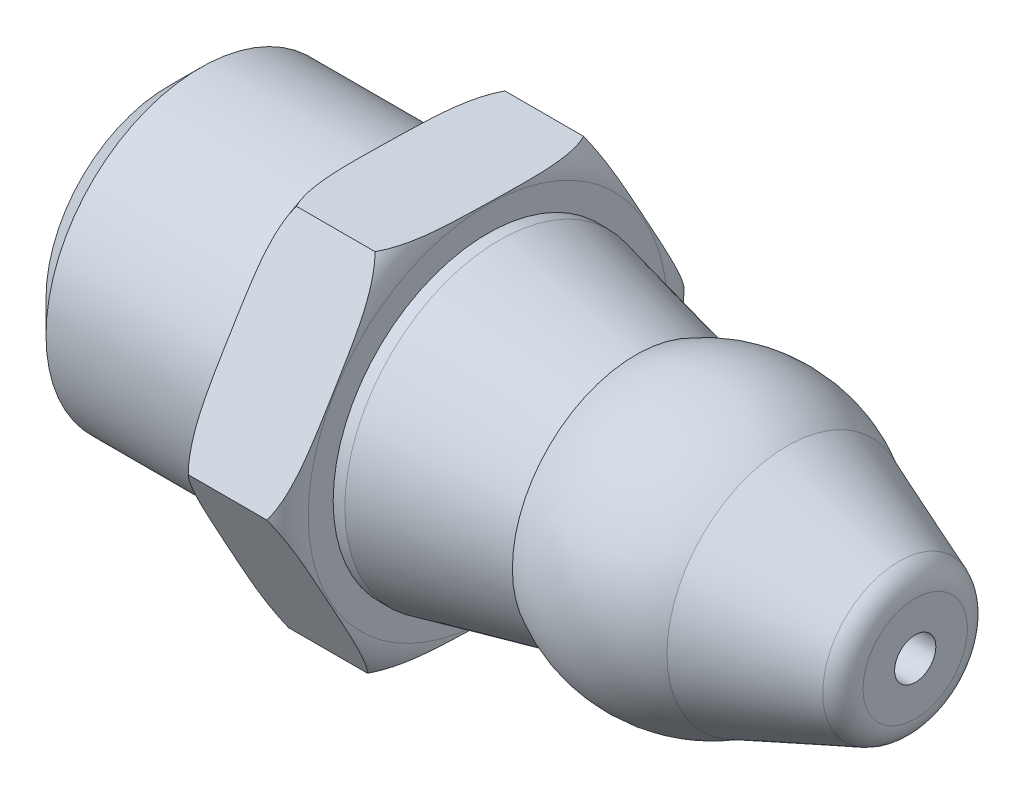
ISO-10303-21;
HEADER;
FILE_DESCRIPTION(('STEP AP214'),'2;1');
FILE_NAME('part.step','',(''),(''),'','','');
FILE_SCHEMA(('AUTOMOTIVE_DESIGN { 1 0 10303 214 1 1 1 1 }'));
ENDSEC;
DATA;
#1=APPLICATION_CONTEXT('core data for automotive mechanical design processes');
#2=APPLICATION_PROTOCOL_DEFINITION('international standard','automotive_design',2000,#1);
#3=PRODUCT_CONTEXT('',#1,'mechanical');
#4=PRODUCT('Part','Part','',(#3));
#5=PRODUCT_RELATED_PRODUCT_CATEGORY('part','',(#4));
#6=PRODUCT_DEFINITION_FORMATION('','',#4);
#7=PRODUCT_DEFINITION_CONTEXT('part definition',#1,'design');
#8=PRODUCT_DEFINITION('design','',#6,#7);
#9=PRODUCT_DEFINITION_SHAPE('','',#8);
#10=(LENGTH_UNIT() NAMED_UNIT(*) SI_UNIT(.MILLI.,.METRE.));
#11=(NAMED_UNIT(*) PLANE_ANGLE_UNIT() SI_UNIT($,.RADIAN.));
#12=(NAMED_UNIT(*) SI_UNIT($,.STERADIAN.) SOLID_ANGLE_UNIT());
#13=UNCERTAINTY_MEASURE_WITH_UNIT(LENGTH_MEASURE(1.E-05),#10,'distance_accuracy_value','');
#14=(GEOMETRIC_REPRESENTATION_CONTEXT(3) GLOBAL_UNCERTAINTY_ASSIGNED_CONTEXT((#13)) GLOBAL_UNIT_ASSIGNED_CONTEXT((#10,
#11,#12)) REPRESENTATION_CONTEXT('',''));
#15=CARTESIAN_POINT('',(0.,0.,0.));
#16=DIRECTION('',(0.,0.,1.));
#17=DIRECTION('',(1.,0.,0.));
#18=AXIS2_PLACEMENT_3D('',#15,#16,#17);
#19=CARTESIAN_POINT('',(-8.30000000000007,-3.46374523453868,2.09880178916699));
#20=DIRECTION('',(0.,-0.48155320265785,0.876416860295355));
#21=DIRECTION('',(0.,-0.876416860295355,-0.48155320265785));
#22=AXIS2_PLACEMENT_3D('',#19,#20,#21);
#23=PLANE('',#22);
#24=DIRECTION('',(-1.,0.,0.));
#25=VECTOR('',#24,1.);
#26=CARTESIAN_POINT('',(-8.30000000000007,-3.46374523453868,2.09880178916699));
#27=LINE('',#26,#25);
#28=CARTESIAN_POINT('',(-8.53532254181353,-3.46374523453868,2.09880178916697));
#29=VERTEX_POINT('',#28);
#30=CARTESIAN_POINT('',(-10.0646774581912,-3.46374523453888,2.09880178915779));
#31=VERTEX_POINT('',#30);
#32=EDGE_CURVE('E108',#29,#31,#27,.T.);
#33=ORIENTED_EDGE('',*,*,#32,.F.);
#34=CARTESIAN_POINT('',(-8.53543708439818,-3.46394523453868,2.09869189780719));
#35=CARTESIAN_POINT('',(-8.51347780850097,-3.42552481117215,2.11980226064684));
#36=CARTESIAN_POINT('',(-8.49395105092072,-3.38612954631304,2.14144825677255));
#37=CARTESIAN_POINT('',(-8.45907671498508,-3.30605710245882,2.18544460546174));
#38=CARTESIAN_POINT('',(-8.44371755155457,-3.26538383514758,2.20779280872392));
#39=CARTESIAN_POINT('',(-8.41638731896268,-3.18323073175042,2.25293238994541));
#40=CARTESIAN_POINT('',(-8.40441381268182,-3.14175149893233,2.27572343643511));
#41=CARTESIAN_POINT('',(-8.38325196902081,-3.05823969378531,2.32160956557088));
#42=CARTESIAN_POINT('',(-8.37406486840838,-3.01620688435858,2.34470477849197));
#43=CARTESIAN_POINT('',(-8.34814483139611,-2.88042419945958,2.4193114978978));
#44=CARTESIAN_POINT('',(-8.33584869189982,-2.78603395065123,2.47117486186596));
#45=CARTESIAN_POINT('',(-8.31802529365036,-2.59673860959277,2.57518447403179));
#46=CARTESIAN_POINT('',(-8.31250722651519,-2.50183299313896,2.62733101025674));
#47=CARTESIAN_POINT('',(-8.30511530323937,-2.31159079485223,2.73186087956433));
#48=CARTESIAN_POINT('',(-8.30325446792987,-2.21625388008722,2.78424439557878));
#49=CARTESIAN_POINT('',(-8.30103361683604,-2.02563238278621,2.88898267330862));
#50=CARTESIAN_POINT('',(-8.30067270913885,-1.93034780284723,2.94133743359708));
#51=CARTESIAN_POINT('',(-8.30030841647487,-1.7391282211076,3.04640433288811));
#52=CARTESIAN_POINT('',(-8.30030748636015,-1.6431932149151,3.09911647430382));
#53=CARTESIAN_POINT('',(-8.30065882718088,-1.45130030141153,3.20455334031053));
#54=CARTESIAN_POINT('',(-8.30101118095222,-1.35534239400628,3.25727806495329));
#55=CARTESIAN_POINT('',(-8.30322090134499,-1.16361255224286,3.36262533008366));
#56=CARTESIAN_POINT('',(-8.30507549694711,-1.06784060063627,3.41524788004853));
#57=CARTESIAN_POINT('',(-8.31248352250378,-0.87637823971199,3.52044817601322));
#58=CARTESIAN_POINT('',(-8.31803668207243,-0.780687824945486,3.57302592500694));
#59=CARTESIAN_POINT('',(-8.33334786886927,-0.61885016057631,3.66194873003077));
#60=CARTESIAN_POINT('',(-8.34130997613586,-0.552581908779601,3.6983602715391));
#61=CARTESIAN_POINT('',(-8.36203746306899,-0.420636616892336,3.77085850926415));
#62=CARTESIAN_POINT('',(-8.37480025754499,-0.354959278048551,3.80694536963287));
#63=CARTESIAN_POINT('',(-8.40679474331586,-0.225333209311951,3.87816929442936));
#64=CARTESIAN_POINT('',(-8.42597002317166,-0.161374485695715,3.91331184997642));
#65=CARTESIAN_POINT('',(-8.46136141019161,-0.0670985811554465,3.96511238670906));
#66=CARTESIAN_POINT('',(-8.47431856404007,-0.0358472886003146,3.98228362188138));
#67=CARTESIAN_POINT('',(-8.50283447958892,0.0257868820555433,4.0161489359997));
#68=CARTESIAN_POINT('',(-8.51839766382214,0.0561681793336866,4.03284214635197));
#69=CARTESIAN_POINT('',(-8.53543708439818,0.0859430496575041,4.04920215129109));
#70=B_SPLINE_CURVE_WITH_KNOTS('',3,(#34,#35,#36,#37,#38,#39,#40,#41,#42,#43,#44,#45,#46,#47,#48,
#49,#50,#51,#52,#53,#54,#55,#56,#57,#58,#59,#60,#61,#62,#63,#64,#65,#66,#67,#68,#69),
.UNSPECIFIED.,.F.,.F.,(4,2,2,2,2,2,2,2,2,2,2,2,2,2,2,2,2,4),(0.,0.146882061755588,
0.293351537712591,0.439715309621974,0.586143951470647,0.910906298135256,1.23610856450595,
1.56246656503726,1.88863047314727,2.21701860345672,2.54548375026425,2.87334438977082,
3.20118106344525,3.42916349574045,3.6570233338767,3.8829291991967,3.99665536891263,
4.11057652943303),.UNSPECIFIED.);
#71=CARTESIAN_POINT('',(-8.53532254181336,0.0857430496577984,4.04909225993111));
#72=VERTEX_POINT('',#71);
#73=EDGE_CURVE('E100',#29,#72,#70,.T.);
#74=ORIENTED_EDGE('',*,*,#73,.T.);
#75=DIRECTION('',(-1.,0.,0.));
#76=VECTOR('',#75,1.);
#77=CARTESIAN_POINT('',(-8.30000000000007,0.0857430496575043,4.04909225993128));
#78=LINE('',#77,#76);
#79=CARTESIAN_POINT('',(-10.0646774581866,0.0857430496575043,4.04909225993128));
#80=VERTEX_POINT('',#79);
#81=EDGE_CURVE('E68',#72,#80,#78,.T.);
#82=ORIENTED_EDGE('',*,*,#81,.T.);
#83=CARTESIAN_POINT('',(-10.064562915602,0.0859430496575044,4.04920215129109));
#84=CARTESIAN_POINT('',(-10.0865221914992,0.0475226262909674,4.02809178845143));
#85=CARTESIAN_POINT('',(-10.1060489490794,0.00812736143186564,4.00644579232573));
#86=CARTESIAN_POINT('',(-10.1409232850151,-0.0719450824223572,3.96244944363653));
#87=CARTESIAN_POINT('',(-10.1562824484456,-0.112618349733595,3.94010124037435));
#88=CARTESIAN_POINT('',(-10.1836126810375,-0.194771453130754,3.89496165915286));
#89=CARTESIAN_POINT('',(-10.1955861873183,-0.236250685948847,3.87217061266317));
#90=CARTESIAN_POINT('',(-10.2167480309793,-0.319762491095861,3.82628448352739));
#91=CARTESIAN_POINT('',(-10.2259351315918,-0.361795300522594,3.80318927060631));
#92=CARTESIAN_POINT('',(-10.251855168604,-0.497577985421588,3.72858255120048));
#93=CARTESIAN_POINT('',(-10.2641513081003,-0.591968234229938,3.67671918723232));
#94=CARTESIAN_POINT('',(-10.2819747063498,-0.781263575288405,3.57270957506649));
#95=CARTESIAN_POINT('',(-10.287492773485,-0.876169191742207,3.52056303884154));
#96=CARTESIAN_POINT('',(-10.2948846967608,-1.06641139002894,3.41603316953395));
#97=CARTESIAN_POINT('',(-10.2967455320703,-1.16174830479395,3.3636496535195));
#98=CARTESIAN_POINT('',(-10.2989663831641,-1.35236980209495,3.25891137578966));
#99=CARTESIAN_POINT('',(-10.2993272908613,-1.44765438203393,3.20655661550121));
#100=CARTESIAN_POINT('',(-10.2996915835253,-1.63887396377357,3.10148971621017));
#101=CARTESIAN_POINT('',(-10.29969251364,-1.73480896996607,3.04877757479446));
#102=CARTESIAN_POINT('',(-10.2993411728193,-1.92670188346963,2.94334070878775));
#103=CARTESIAN_POINT('',(-10.2989888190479,-2.02265979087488,2.89061598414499));
#104=CARTESIAN_POINT('',(-10.2967790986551,-2.2143896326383,2.78526871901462));
#105=CARTESIAN_POINT('',(-10.294924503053,-2.31016158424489,2.73264616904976));
#106=CARTESIAN_POINT('',(-10.2875164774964,-2.50162394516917,2.62744587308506));
#107=CARTESIAN_POINT('',(-10.2819633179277,-2.59731435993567,2.57486812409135));
#108=CARTESIAN_POINT('',(-10.2666521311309,-2.75915202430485,2.48594531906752));
#109=CARTESIAN_POINT('',(-10.2586900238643,-2.82542027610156,2.44953377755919));
#110=CARTESIAN_POINT('',(-10.2379625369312,-2.95736556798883,2.37703553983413));
#111=CARTESIAN_POINT('',(-10.2251997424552,-3.02304290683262,2.34094867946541));
#112=CARTESIAN_POINT('',(-10.1932052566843,-3.15266897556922,2.26972475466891));
#113=CARTESIAN_POINT('',(-10.1740299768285,-3.21662769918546,2.23458219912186));
#114=CARTESIAN_POINT('',(-10.1386385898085,-3.31090360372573,2.18278166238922));
#115=CARTESIAN_POINT('',(-10.1256814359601,-3.34215489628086,2.16561042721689));
#116=CARTESIAN_POINT('',(-10.0971655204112,-3.40378906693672,2.13174511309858));
#117=CARTESIAN_POINT('',(-10.081602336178,-3.43417036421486,2.1150519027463));
#118=CARTESIAN_POINT('',(-10.064562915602,-3.46394523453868,2.09869189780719));
#119=B_SPLINE_CURVE_WITH_KNOTS('',3,(#83,#84,#85,#86,#87,#88,#89,#90,#91,#92,#93,#94,#95,#96,
#97,#98,#99,#100,#101,#102,#103,#104,#105,#106,#107,#108,#109,#110,#111,#112,#113,#114,#115,
#116,#117,#118),.UNSPECIFIED.,.F.,.F.,(4,2,2,2,2,2,2,2,2,2,2,2,2,2,2,2,2,4),(0.,
0.146882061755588,0.293351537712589,0.43971530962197,0.586143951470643,0.910906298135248,
1.23610856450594,1.56246656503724,1.88863047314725,2.2170186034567,2.54548375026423,
2.8733443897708,3.20118106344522,3.42916349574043,3.65702333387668,3.8829291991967,
3.99665536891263,4.11057652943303),.UNSPECIFIED.);
#120=EDGE_CURVE('E119',#80,#31,#119,.T.);
#121=ORIENTED_EDGE('',*,*,#120,.T.);
#122=EDGE_LOOP('',(#33,#74,#82,#121));
#123=FACE_BOUND('',#122,.T.);
#124=ADVANCED_FACE('F44',(#123),#23,.T.);
#125=CARTESIAN_POINT('',(-8.30000000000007,-3.54948828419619,-1.95029047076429));
#126=DIRECTION('',(0.,-0.9997758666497,0.0211711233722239));
#127=DIRECTION('',(0.,-0.0211711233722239,-0.9997758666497));
#128=AXIS2_PLACEMENT_3D('',#125,#126,#127);
#129=PLANE('',#128);
#130=DIRECTION('',(-1.,0.,0.));
#131=VECTOR('',#130,1.);
#132=CARTESIAN_POINT('',(-8.30000000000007,-3.54948828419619,-1.95029047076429));
#133=LINE('',#132,#131);
#134=CARTESIAN_POINT('',(-8.53532254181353,-3.54948828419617,-1.95029047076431));
#135=VERTEX_POINT('',#134);
#136=CARTESIAN_POINT('',(-10.0646774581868,-3.5494882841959,-1.95029047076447));
#137=VERTEX_POINT('',#136);
#138=EDGE_CURVE('E278',#135,#137,#133,.T.);
#139=ORIENTED_EDGE('',*,*,#138,.F.);
#140=CARTESIAN_POINT('',(-8.53542294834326,-3.54949251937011,-1.95049047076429));
#141=CARTESIAN_POINT('',(-8.51346374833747,-3.54856436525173,-1.90665972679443));
#142=CARTESIAN_POINT('',(-8.49393718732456,-3.54761266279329,-1.86171694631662));
#143=CARTESIAN_POINT('',(-8.45906341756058,-3.54567829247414,-1.77036908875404));
#144=CARTESIAN_POINT('',(-8.44370462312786,-3.54469571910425,-1.72396847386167));
#145=CARTESIAN_POINT('',(-8.4163751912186,-3.54271108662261,-1.63024705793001));
#146=CARTESIAN_POINT('',(-8.40440212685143,-3.54170904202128,-1.58292694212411));
#147=CARTESIAN_POINT('',(-8.38324124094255,-3.53969158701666,-1.4876555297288));
#148=CARTESIAN_POINT('',(-8.37405465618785,-3.53867617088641,-1.4397039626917));
#149=CARTESIAN_POINT('',(-8.3481360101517,-3.53539593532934,-1.28479955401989));
#150=CARTESIAN_POINT('',(-8.33584099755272,-3.53311564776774,-1.17711625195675));
#151=CARTESIAN_POINT('',(-8.31801982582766,-3.52854263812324,-0.961162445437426));
#152=CARTESIAN_POINT('',(-8.31250285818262,-3.52624990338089,-0.852891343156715));
#153=CARTESIAN_POINT('',(-8.30511278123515,-3.52165402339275,-0.635857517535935));
#154=CARTESIAN_POINT('',(-8.30325269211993,-3.51935087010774,-0.527094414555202));
#155=CARTESIAN_POINT('',(-8.30103288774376,-3.51474582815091,-0.309627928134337));
#156=CARTESIAN_POINT('',(-8.3006722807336,-3.51244393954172,-0.200924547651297));
#157=CARTESIAN_POINT('',(-8.30030836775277,-3.507824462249,0.017223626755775));
#158=CARTESIAN_POINT('',(-8.30030751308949,-3.50550687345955,0.126668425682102));
#159=CARTESIAN_POINT('',(-8.30065932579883,-3.50087114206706,0.345584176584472));
#160=CARTESIAN_POINT('',(-8.30101207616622,-3.49855299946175,0.45505512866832));
#161=CARTESIAN_POINT('',(-8.30322371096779,-3.49392121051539,0.673784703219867));
#162=CARTESIAN_POINT('',(-8.30507982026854,-3.49160756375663,0.78304334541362));
#163=CARTESIAN_POINT('',(-8.31249297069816,-3.48698224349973,1.00146744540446));
#164=CARTESIAN_POINT('',(-8.31804973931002,-3.48467056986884,1.11063290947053));
#165=CARTESIAN_POINT('',(-8.33336778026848,-3.48076147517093,1.29523428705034));
#166=CARTESIAN_POINT('',(-8.34133111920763,-3.4791611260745,1.37080847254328));
#167=CARTESIAN_POINT('',(-8.36205950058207,-3.47597470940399,1.52128241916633));
#168=CARTESIAN_POINT('',(-8.37482195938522,-3.47438863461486,1.59618252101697));
#169=CARTESIAN_POINT('',(-8.40681303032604,-3.47125822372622,1.74401167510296));
#170=CARTESIAN_POINT('',(-8.42598529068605,-3.46971364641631,1.81695211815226));
#171=CARTESIAN_POINT('',(-8.4613687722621,-3.46743691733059,1.92446737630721));
#172=CARTESIAN_POINT('',(-8.47432268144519,-3.46668221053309,1.96010731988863));
#173=CARTESIAN_POINT('',(-8.50283064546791,-3.46519376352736,2.03039709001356));
#174=CARTESIAN_POINT('',(-8.51838911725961,-3.46446006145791,2.06504511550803));
#175=CARTESIAN_POINT('',(-8.53542294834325,-3.46374099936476,2.09900178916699));
#176=B_SPLINE_CURVE_WITH_KNOTS('',3,(#140,#141,#142,#143,#144,#145,#146,#147,#148,#149,#150,
#151,#152,#153,#154,#155,#156,#157,#158,#159,#160,#161,#162,#163,#164,#165,#166,#167,#168,#169,
#170,#171,#172,#173,#174,#175),.UNSPECIFIED.,.F.,.F.,(4,2,2,2,2,2,2,2,2,2,2,2,2,2,2,2,2,4),(0.,
0.146888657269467,0.293364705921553,0.439735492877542,0.586171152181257,0.910954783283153,
1.23617835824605,1.56255779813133,1.88874311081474,2.21715097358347,2.54563593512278,
2.87351590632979,3.20137173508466,3.42929019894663,3.65708613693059,3.8829298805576,
3.99662435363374,4.11051362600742),.UNSPECIFIED.);
#177=EDGE_CURVE('E111',#135,#29,#176,.T.);
#178=ORIENTED_EDGE('',*,*,#177,.T.);
#179=ORIENTED_EDGE('',*,*,#32,.T.);
#180=CARTESIAN_POINT('',(-10.0645770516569,-3.46374099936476,2.09900178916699));
#181=CARTESIAN_POINT('',(-10.0865362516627,-3.46466915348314,2.05517104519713));
#182=CARTESIAN_POINT('',(-10.1060628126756,-3.46562085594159,2.01022826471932));
#183=CARTESIAN_POINT('',(-10.1409365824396,-3.46755522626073,1.91888040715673));
#184=CARTESIAN_POINT('',(-10.1562953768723,-3.46853779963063,1.87247979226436));
#185=CARTESIAN_POINT('',(-10.1836248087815,-3.47052243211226,1.7787583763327));
#186=CARTESIAN_POINT('',(-10.1955978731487,-3.47152447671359,1.7314382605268));
#187=CARTESIAN_POINT('',(-10.2167587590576,-3.47354193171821,1.63616684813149));
#188=CARTESIAN_POINT('',(-10.2259453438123,-3.47455734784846,1.58821528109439));
#189=CARTESIAN_POINT('',(-10.2518639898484,-3.47783758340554,1.43331087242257));
#190=CARTESIAN_POINT('',(-10.2641590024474,-3.48011787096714,1.32562757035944));
#191=CARTESIAN_POINT('',(-10.2819801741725,-3.48469088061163,1.10967376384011));
#192=CARTESIAN_POINT('',(-10.2874971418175,-3.48698361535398,1.0014026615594));
#193=CARTESIAN_POINT('',(-10.294887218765,-3.49157949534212,0.784368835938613));
#194=CARTESIAN_POINT('',(-10.2967473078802,-3.49388264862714,0.675605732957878));
#195=CARTESIAN_POINT('',(-10.2989671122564,-3.49848769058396,0.45813924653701));
#196=CARTESIAN_POINT('',(-10.2993277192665,-3.50078957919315,0.349435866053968));
#197=CARTESIAN_POINT('',(-10.2996916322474,-3.50540905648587,0.131287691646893));
#198=CARTESIAN_POINT('',(-10.2996924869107,-3.50772664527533,0.0218428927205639));
#199=CARTESIAN_POINT('',(-10.2993406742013,-3.51236237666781,-0.197072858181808));
#200=CARTESIAN_POINT('',(-10.2989879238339,-3.51468051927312,-0.306543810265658));
#201=CARTESIAN_POINT('',(-10.2967762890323,-3.51931230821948,-0.525273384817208));
#202=CARTESIAN_POINT('',(-10.2949201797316,-3.52162595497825,-0.634532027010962));
#203=CARTESIAN_POINT('',(-10.287507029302,-3.52625127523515,-0.852956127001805));
#204=CARTESIAN_POINT('',(-10.2819502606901,-3.52856294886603,-0.962121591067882));
#205=CARTESIAN_POINT('',(-10.2666322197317,-3.53247204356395,-1.14672296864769));
#206=CARTESIAN_POINT('',(-10.2586688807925,-3.53407239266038,-1.22229715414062));
#207=CARTESIAN_POINT('',(-10.2379404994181,-3.53725880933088,-1.37277110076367));
#208=CARTESIAN_POINT('',(-10.2251780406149,-3.53884488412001,-1.4476712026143));
#209=CARTESIAN_POINT('',(-10.1931869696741,-3.54197529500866,-1.59550035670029));
#210=CARTESIAN_POINT('',(-10.1740147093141,-3.54351987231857,-1.66844079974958));
#211=CARTESIAN_POINT('',(-10.138631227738,-3.54579660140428,-1.77595605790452));
#212=CARTESIAN_POINT('',(-10.1256773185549,-3.54655130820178,-1.81159600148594));
#213=CARTESIAN_POINT('',(-10.0971693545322,-3.54803975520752,-1.88188577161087));
#214=CARTESIAN_POINT('',(-10.0816108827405,-3.54877345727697,-1.91653379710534));
#215=CARTESIAN_POINT('',(-10.0645770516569,-3.54949251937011,-1.95049047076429));
#216=B_SPLINE_CURVE_WITH_KNOTS('',3,(#180,#181,#182,#183,#184,#185,#186,#187,#188,#189,#190,
#191,#192,#193,#194,#195,#196,#197,#198,#199,#200,#201,#202,#203,#204,#205,#206,#207,#208,#209,
#210,#211,#212,#213,#214,#215),.UNSPECIFIED.,.F.,.F.,(4,2,2,2,2,2,2,2,2,2,2,2,2,2,2,2,2,4),(0.,
0.146888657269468,0.293364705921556,0.439735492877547,0.586171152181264,0.910954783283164,
1.23617835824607,1.56255779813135,1.88874311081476,2.2171509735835,2.54563593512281,
2.87351590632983,3.2013717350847,3.42929019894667,3.65708613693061,3.88292988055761,
3.99662435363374,4.11051362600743),.UNSPECIFIED.);
#217=EDGE_CURVE('E125',#31,#137,#216,.T.);
#218=ORIENTED_EDGE('',*,*,#217,.T.);
#219=EDGE_LOOP('',(#139,#178,#179,#218));
#220=FACE_BOUND('',#219,.T.);
#221=ADVANCED_FACE('F174',(#220),#129,.T.);
#222=CARTESIAN_POINT('',(-8.30000000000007,-0.085743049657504,-4.04909225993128));
#223=DIRECTION('',(0.,-0.518222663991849,-0.855245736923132));
#224=DIRECTION('',(0.,0.855245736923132,-0.518222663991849));
#225=AXIS2_PLACEMENT_3D('',#222,#223,#224);
#226=PLANE('',#225);
#227=DIRECTION('',(-1.,0.,0.));
#228=VECTOR('',#227,1.);
#229=CARTESIAN_POINT('',(-8.30000000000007,-0.085743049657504,-4.04909225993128));
#230=LINE('',#229,#228);
#231=CARTESIAN_POINT('',(-8.53532254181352,-0.0857430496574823,-4.04909225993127));
#232=VERTEX_POINT('',#231);
#233=CARTESIAN_POINT('',(-10.0646774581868,-0.0857430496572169,-4.04909225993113));
#234=VERTEX_POINT('',#233);
#235=EDGE_CURVE('E286',#232,#234,#230,.T.);
#236=ORIENTED_EDGE('',*,*,#235,.F.);
#237=CARTESIAN_POINT('',(-8.53543992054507,-0.085543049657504,-4.04921344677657));
#238=CARTESIAN_POINT('',(-8.51348062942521,-0.123034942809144,-4.02649582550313));
#239=CARTESIAN_POINT('',(-8.49395383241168,-0.161478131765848,-4.00320178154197));
#240=CARTESIAN_POINT('',(-8.45907938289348,-0.239615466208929,-3.95585569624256));
#241=CARTESIAN_POINT('',(-8.4437201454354,-0.279305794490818,-3.93180596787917));
#242=CARTESIAN_POINT('',(-8.41638975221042,-0.359473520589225,-3.88322959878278));
#243=CARTESIAN_POINT('',(-8.4044161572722,-0.399950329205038,-3.85870331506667));
#244=CARTESIAN_POINT('',(-8.38325412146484,-0.481443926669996,-3.80932355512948));
#245=CARTESIAN_POINT('',(-8.37406691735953,-0.522460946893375,-3.78446993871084));
#246=CARTESIAN_POINT('',(-8.34814660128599,-0.654961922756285,-3.70418306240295));
#247=CARTESIAN_POINT('',(-8.3358502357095,-0.747070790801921,-3.64837114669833));
#248=CARTESIAN_POINT('',(-8.31802639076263,-0.93179095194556,-3.53644287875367));
#249=CARTESIAN_POINT('',(-8.31250810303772,-1.02440275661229,-3.48032621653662));
#250=CARTESIAN_POINT('',(-8.30511580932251,-1.21004692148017,-3.36783806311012));
#251=CARTESIAN_POINT('',(-8.30325482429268,-1.30307960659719,-3.31146637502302));
#252=CARTESIAN_POINT('',(-8.30103376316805,-1.48909391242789,-3.19875394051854));
#253=CARTESIAN_POINT('',(-8.30067279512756,-1.58207553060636,-3.14241319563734));
#254=CARTESIAN_POINT('',(-8.3003084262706,-1.76867357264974,-3.02934705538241));
#255=CARTESIAN_POINT('',(-8.30030748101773,-1.86229000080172,-2.97262165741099));
#256=CARTESIAN_POINT('',(-8.30065872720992,-2.04954520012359,-2.85915732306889));
#257=CARTESIAN_POINT('',(-8.30101100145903,-2.14318397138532,-2.80241838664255));
#258=CARTESIAN_POINT('',(-8.30322033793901,-2.33028006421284,-2.68905046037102));
#259=CARTESIAN_POINT('',(-8.30507462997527,-2.42373740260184,-2.63242146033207));
#260=CARTESIAN_POINT('',(-8.31248162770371,-2.6105725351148,-2.51921165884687));
#261=CARTESIAN_POINT('',(-8.31803406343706,-2.70395033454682,-2.46263085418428));
#262=CARTESIAN_POINT('',(-8.33334387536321,-2.86188124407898,-2.36693511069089));
#263=CARTESIAN_POINT('',(-8.34130573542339,-2.92655239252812,-2.32774864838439));
#264=CARTESIAN_POINT('',(-8.36203304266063,-3.05531775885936,-2.24972530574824));
#265=CARTESIAN_POINT('',(-8.37479590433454,-3.11941226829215,-2.21088824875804));
#266=CARTESIAN_POINT('',(-8.40679107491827,-3.24591428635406,-2.13423634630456));
#267=CARTESIAN_POINT('',(-8.42596696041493,-3.30833154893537,-2.09641559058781));
#268=CARTESIAN_POINT('',(-8.46135993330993,-3.40033528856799,-2.04066737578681));
#269=CARTESIAN_POINT('',(-8.47431773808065,-3.43083339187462,-2.02218753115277));
#270=CARTESIAN_POINT('',(-8.50283524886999,-3.49098207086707,-1.98574138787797));
#271=CARTESIAN_POINT('',(-8.51839937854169,-3.52063110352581,-1.96777602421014));
#272=CARTESIAN_POINT('',(-8.53543992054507,-3.54968828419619,-1.95016928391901));
#273=B_SPLINE_CURVE_WITH_KNOTS('',3,(#237,#238,#239,#240,#241,#242,#243,#244,#245,#246,#247,
#248,#249,#250,#251,#252,#253,#254,#255,#256,#257,#258,#259,#260,#261,#262,#263,#264,#265,#266,
#267,#268,#269,#270,#271,#272),.UNSPECIFIED.,.F.,.F.,(4,2,2,2,2,2,2,2,2,2,2,2,2,2,2,2,2,4),(0.,
0.146880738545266,0.293348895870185,0.439711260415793,0.586138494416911,0.910896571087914,
1.23609456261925,1.56244826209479,1.88860787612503,2.21699204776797,2.54545321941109,
2.87330998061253,3.20114281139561,3.42913807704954,3.65701073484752,3.88292906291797,
3.99666159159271,4.11058914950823),.UNSPECIFIED.);
#274=EDGE_CURVE('E239',#232,#135,#273,.T.);
#275=ORIENTED_EDGE('',*,*,#274,.T.);
#276=ORIENTED_EDGE('',*,*,#138,.T.);
#277=CARTESIAN_POINT('',(-10.0645600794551,-3.54968828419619,-1.95016928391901));
#278=CARTESIAN_POINT('',(-10.0865193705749,-3.51219639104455,-1.97288690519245));
#279=CARTESIAN_POINT('',(-10.1060461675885,-3.47375320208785,-1.99618094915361));
#280=CARTESIAN_POINT('',(-10.1409206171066,-3.39561586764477,-2.04352703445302));
#281=CARTESIAN_POINT('',(-10.1562798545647,-3.35592553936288,-2.06757676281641));
#282=CARTESIAN_POINT('',(-10.1836102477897,-3.27575781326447,-2.11615313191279));
#283=CARTESIAN_POINT('',(-10.1955838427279,-3.23528100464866,-2.14067941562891));
#284=CARTESIAN_POINT('',(-10.2167458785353,-3.1537874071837,-2.1900591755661));
#285=CARTESIAN_POINT('',(-10.2259330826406,-3.11277038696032,-2.21491279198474));
#286=CARTESIAN_POINT('',(-10.2518533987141,-2.98026941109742,-2.29519966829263));
#287=CARTESIAN_POINT('',(-10.2641497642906,-2.88816054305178,-2.35101158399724));
#288=CARTESIAN_POINT('',(-10.2819736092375,-2.70344038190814,-2.4629398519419));
#289=CARTESIAN_POINT('',(-10.2874918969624,-2.61082857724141,-2.51905651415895));
#290=CARTESIAN_POINT('',(-10.2948841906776,-2.42518441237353,-2.63154466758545));
#291=CARTESIAN_POINT('',(-10.2967451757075,-2.33215172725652,-2.68791635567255));
#292=CARTESIAN_POINT('',(-10.2989662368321,-2.14613742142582,-2.80062879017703));
#293=CARTESIAN_POINT('',(-10.2993272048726,-2.05315580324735,-2.85696953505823));
#294=CARTESIAN_POINT('',(-10.2996915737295,-1.86655776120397,-2.97003567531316));
#295=CARTESIAN_POINT('',(-10.2996925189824,-1.77294133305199,-3.02676107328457));
#296=CARTESIAN_POINT('',(-10.2993412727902,-1.58568613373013,-3.14022540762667));
#297=CARTESIAN_POINT('',(-10.2989889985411,-1.4920473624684,-3.19696434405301));
#298=CARTESIAN_POINT('',(-10.2967796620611,-1.30495126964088,-3.31033227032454));
#299=CARTESIAN_POINT('',(-10.2949253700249,-1.21149393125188,-3.36696127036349));
#300=CARTESIAN_POINT('',(-10.2875183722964,-1.02465879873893,-3.48017107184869));
#301=CARTESIAN_POINT('',(-10.2819659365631,-0.931280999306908,-3.53675187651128));
#302=CARTESIAN_POINT('',(-10.2666561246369,-0.77335008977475,-3.63244762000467));
#303=CARTESIAN_POINT('',(-10.2586942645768,-0.708678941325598,-3.67163408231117));
#304=CARTESIAN_POINT('',(-10.2379669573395,-0.579913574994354,-3.74965742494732));
#305=CARTESIAN_POINT('',(-10.2252040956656,-0.515819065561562,-3.78849448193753));
#306=CARTESIAN_POINT('',(-10.1932089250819,-0.38931704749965,-3.86514638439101));
#307=CARTESIAN_POINT('',(-10.1740330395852,-0.326899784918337,-3.90296714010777));
#308=CARTESIAN_POINT('',(-10.1386400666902,-0.234896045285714,-3.95871535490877));
#309=CARTESIAN_POINT('',(-10.1256822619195,-0.204397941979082,-3.9771951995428));
#310=CARTESIAN_POINT('',(-10.0971647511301,-0.144249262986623,-4.0136413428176));
#311=CARTESIAN_POINT('',(-10.0816006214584,-0.114600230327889,-4.03160670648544));
#312=CARTESIAN_POINT('',(-10.0645600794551,-0.085543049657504,-4.04921344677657));
#313=B_SPLINE_CURVE_WITH_KNOTS('',3,(#277,#278,#279,#280,#281,#282,#283,#284,#285,#286,#287,
#288,#289,#290,#291,#292,#293,#294,#295,#296,#297,#298,#299,#300,#301,#302,#303,#304,#305,#306,
#307,#308,#309,#310,#311,#312),.UNSPECIFIED.,.F.,.F.,(4,2,2,2,2,2,2,2,2,2,2,2,2,2,2,2,2,4),(0.,
0.146880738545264,0.293348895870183,0.439711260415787,0.586138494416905,0.910896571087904,
1.23609456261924,1.56244826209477,1.88860787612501,2.21699204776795,2.54545321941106,
2.87330998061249,3.20114281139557,3.42913807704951,3.6570107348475,3.88292906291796,
3.99666159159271,4.11058914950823),.UNSPECIFIED.);
#314=EDGE_CURVE('E256',#137,#234,#313,.T.);
#315=ORIENTED_EDGE('',*,*,#314,.T.);
#316=EDGE_LOOP('',(#236,#275,#276,#315));
#317=FACE_BOUND('',#316,.T.);
#318=ADVANCED_FACE('F179',(#317),#226,.T.);
#319=CARTESIAN_POINT('',(-8.30000000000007,3.46374523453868,-2.09880178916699));
#320=DIRECTION('',(0.,0.48155320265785,-0.876416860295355));
#321=DIRECTION('',(0.,0.876416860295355,0.48155320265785));
#322=AXIS2_PLACEMENT_3D('',#319,#320,#321);
#323=PLANE('',#322);
#324=DIRECTION('',(-1.,0.,0.));
#325=VECTOR('',#324,1.);
#326=CARTESIAN_POINT('',(-8.30000000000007,3.46374523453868,-2.09880178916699));
#327=LINE('',#326,#325);
#328=CARTESIAN_POINT('',(-8.53532254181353,3.46374523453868,-2.09880178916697));
#329=VERTEX_POINT('',#328);
#330=CARTESIAN_POINT('',(-10.0646774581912,3.46374523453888,-2.09880178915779));
#331=VERTEX_POINT('',#330);
#332=EDGE_CURVE('E123',#329,#331,#327,.T.);
#333=ORIENTED_EDGE('',*,*,#332,.F.);
#334=CARTESIAN_POINT('',(-8.53543708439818,3.46394523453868,-2.09869189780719));
#335=CARTESIAN_POINT('',(-8.51347780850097,3.42552481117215,-2.11980226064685));
#336=CARTESIAN_POINT('',(-8.49395105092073,3.38612954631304,-2.14144825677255));
#337=CARTESIAN_POINT('',(-8.45907671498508,3.30605710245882,-2.18544460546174));
#338=CARTESIAN_POINT('',(-8.44371755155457,3.26538383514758,-2.20779280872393));
#339=CARTESIAN_POINT('',(-8.41638731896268,3.18323073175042,-2.25293238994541));
#340=CARTESIAN_POINT('',(-8.40441381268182,3.14175149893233,-2.27572343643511));
#341=CARTESIAN_POINT('',(-8.38325196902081,3.05823969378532,-2.32160956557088));
#342=CARTESIAN_POINT('',(-8.37406486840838,3.01620688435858,-2.34470477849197));
#343=CARTESIAN_POINT('',(-8.34814483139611,2.88042419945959,-2.4193114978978));
#344=CARTESIAN_POINT('',(-8.33584869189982,2.78603395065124,-2.47117486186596));
#345=CARTESIAN_POINT('',(-8.31802529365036,2.59673860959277,-2.57518447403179));
#346=CARTESIAN_POINT('',(-8.31250722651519,2.50183299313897,-2.62733101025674));
#347=CARTESIAN_POINT('',(-8.30511530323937,2.31159079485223,-2.73186087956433));
#348=CARTESIAN_POINT('',(-8.30325446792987,2.21625388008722,-2.78424439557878));
#349=CARTESIAN_POINT('',(-8.30103361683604,2.02563238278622,-2.88898267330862));
#350=CARTESIAN_POINT('',(-8.30067270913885,1.93034780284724,-2.94133743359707));
#351=CARTESIAN_POINT('',(-8.30030841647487,1.7391282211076,-3.04640433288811));
#352=CARTESIAN_POINT('',(-8.30030748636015,1.6431932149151,-3.09911647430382));
#353=CARTESIAN_POINT('',(-8.30065882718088,1.45130030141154,-3.20455334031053));
#354=CARTESIAN_POINT('',(-8.30101118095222,1.35534239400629,-3.25727806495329));
#355=CARTESIAN_POINT('',(-8.30322090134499,1.16361255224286,-3.36262533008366));
#356=CARTESIAN_POINT('',(-8.30507549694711,1.06784060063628,-3.41524788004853));
#357=CARTESIAN_POINT('',(-8.31248352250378,0.876378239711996,-3.52044817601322));
#358=CARTESIAN_POINT('',(-8.31803668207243,0.780687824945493,-3.57302592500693));
#359=CARTESIAN_POINT('',(-8.33334786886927,0.618850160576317,-3.66194873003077));
#360=CARTESIAN_POINT('',(-8.34130997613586,0.552581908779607,-3.69836027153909));
#361=CARTESIAN_POINT('',(-8.36203746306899,0.42063661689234,-3.77085850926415));
#362=CARTESIAN_POINT('',(-8.37480025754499,0.354959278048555,-3.80694536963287));
#363=CARTESIAN_POINT('',(-8.40679474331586,0.225333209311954,-3.87816929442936));
#364=CARTESIAN_POINT('',(-8.42597002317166,0.161374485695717,-3.91331184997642));
#365=CARTESIAN_POINT('',(-8.46136141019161,0.0670985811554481,-3.96511238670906));
#366=CARTESIAN_POINT('',(-8.47431856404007,0.0358472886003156,-3.98228362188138));
#367=CARTESIAN_POINT('',(-8.50283447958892,-0.025786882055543,-4.01614893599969));
#368=CARTESIAN_POINT('',(-8.51839766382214,-0.0561681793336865,-4.03284214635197));
#369=CARTESIAN_POINT('',(-8.53543708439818,-0.085943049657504,-4.04920215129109));
#370=B_SPLINE_CURVE_WITH_KNOTS('',3,(#334,#335,#336,#337,#338,#339,#340,#341,#342,#343,#344,
#345,#346,#347,#348,#349,#350,#351,#352,#353,#354,#355,#356,#357,#358,#359,#360,#361,#362,#363,
#364,#365,#366,#367,#368,#369),.UNSPECIFIED.,.F.,.F.,(4,2,2,2,2,2,2,2,2,2,2,2,2,2,2,2,2,4),(0.,
0.146882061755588,0.29335153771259,0.439715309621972,0.586143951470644,0.910906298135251,
1.23610856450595,1.56246656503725,1.88863047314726,2.21701860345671,2.54548375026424,
2.87334438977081,3.20118106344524,3.42916349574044,3.65702333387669,3.8829291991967,
3.99665536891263,4.11057652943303),.UNSPECIFIED.);
#371=EDGE_CURVE('E233',#329,#232,#370,.T.);
#372=ORIENTED_EDGE('',*,*,#371,.T.);
#373=ORIENTED_EDGE('',*,*,#235,.T.);
#374=CARTESIAN_POINT('',(-10.064562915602,-0.085943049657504,-4.04920215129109));
#375=CARTESIAN_POINT('',(-10.0865221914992,-0.0475226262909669,-4.02809178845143));
#376=CARTESIAN_POINT('',(-10.1060489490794,-0.00812736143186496,-4.00644579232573));
#377=CARTESIAN_POINT('',(-10.1409232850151,0.0719450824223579,-3.96244944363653));
#378=CARTESIAN_POINT('',(-10.1562824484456,0.112618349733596,-3.94010124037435));
#379=CARTESIAN_POINT('',(-10.1836126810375,0.194771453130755,-3.89496165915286));
#380=CARTESIAN_POINT('',(-10.1955861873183,0.236250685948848,-3.87217061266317));
#381=CARTESIAN_POINT('',(-10.2167480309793,0.319762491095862,-3.82628448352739));
#382=CARTESIAN_POINT('',(-10.2259351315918,0.361795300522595,-3.80318927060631));
#383=CARTESIAN_POINT('',(-10.251855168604,0.497577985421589,-3.72858255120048));
#384=CARTESIAN_POINT('',(-10.2641513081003,0.59196823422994,-3.67671918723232));
#385=CARTESIAN_POINT('',(-10.2819747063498,0.781263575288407,-3.57270957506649));
#386=CARTESIAN_POINT('',(-10.287492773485,0.876169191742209,-3.52056303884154));
#387=CARTESIAN_POINT('',(-10.2948846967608,1.06641139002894,-3.41603316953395));
#388=CARTESIAN_POINT('',(-10.2967455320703,1.16174830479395,-3.3636496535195));
#389=CARTESIAN_POINT('',(-10.2989663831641,1.35236980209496,-3.25891137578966));
#390=CARTESIAN_POINT('',(-10.2993272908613,1.44765438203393,-3.20655661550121));
#391=CARTESIAN_POINT('',(-10.2996915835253,1.63887396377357,-3.10148971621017));
#392=CARTESIAN_POINT('',(-10.29969251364,1.73480896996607,-3.04877757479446));
#393=CARTESIAN_POINT('',(-10.2993411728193,1.92670188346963,-2.94334070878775));
#394=CARTESIAN_POINT('',(-10.2989888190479,2.02265979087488,-2.89061598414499));
#395=CARTESIAN_POINT('',(-10.2967790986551,2.21438963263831,-2.78526871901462));
#396=CARTESIAN_POINT('',(-10.294924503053,2.3101615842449,-2.73264616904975));
#397=CARTESIAN_POINT('',(-10.2875164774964,2.50162394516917,-2.62744587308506));
#398=CARTESIAN_POINT('',(-10.2819633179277,2.59731435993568,-2.57486812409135));
#399=CARTESIAN_POINT('',(-10.2666521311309,2.75915202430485,-2.48594531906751));
#400=CARTESIAN_POINT('',(-10.2586900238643,2.82542027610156,-2.44953377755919));
#401=CARTESIAN_POINT('',(-10.2379625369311,2.95736556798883,-2.37703553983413));
#402=CARTESIAN_POINT('',(-10.2251997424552,3.02304290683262,-2.34094867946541));
#403=CARTESIAN_POINT('',(-10.1932052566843,3.15266897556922,-2.26972475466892));
#404=CARTESIAN_POINT('',(-10.1740299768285,3.21662769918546,-2.23458219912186));
#405=CARTESIAN_POINT('',(-10.1386385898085,3.31090360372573,-2.18278166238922));
#406=CARTESIAN_POINT('',(-10.1256814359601,3.34215489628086,-2.1656104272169));
#407=CARTESIAN_POINT('',(-10.0971655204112,3.40378906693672,-2.13174511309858));
#408=CARTESIAN_POINT('',(-10.081602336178,3.43417036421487,-2.11505190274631));
#409=CARTESIAN_POINT('',(-10.064562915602,3.46394523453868,-2.09869189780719));
#410=B_SPLINE_CURVE_WITH_KNOTS('',3,(#374,#375,#376,#377,#378,#379,#380,#381,#382,#383,#384,
#385,#386,#387,#388,#389,#390,#391,#392,#393,#394,#395,#396,#397,#398,#399,#400,#401,#402,#403,
#404,#405,#406,#407,#408,#409),.UNSPECIFIED.,.F.,.F.,(4,2,2,2,2,2,2,2,2,2,2,2,2,2,2,2,2,4),(0.,
0.146882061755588,0.29335153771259,0.439715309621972,0.586143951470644,0.910906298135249,
1.23610856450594,1.56246656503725,1.88863047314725,2.2170186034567,2.54548375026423,
2.8733443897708,3.20118106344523,3.42916349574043,3.65702333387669,3.8829291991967,
3.99665536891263,4.11057652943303),.UNSPECIFIED.);
#411=EDGE_CURVE('E264',#234,#331,#410,.T.);
#412=ORIENTED_EDGE('',*,*,#411,.T.);
#413=EDGE_LOOP('',(#333,#372,#373,#412));
#414=FACE_BOUND('',#413,.T.);
#415=ADVANCED_FACE('F249',(#414),#323,.T.);
#416=CARTESIAN_POINT('',(-8.30000000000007,3.54948828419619,1.95029047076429));
#417=DIRECTION('',(0.,0.9997758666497,-0.0211711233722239));
#418=DIRECTION('',(0.,0.0211711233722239,0.9997758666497));
#419=AXIS2_PLACEMENT_3D('',#416,#417,#418);
#420=PLANE('',#419);
#421=DIRECTION('',(-1.,0.,0.));
#422=VECTOR('',#421,1.);
#423=CARTESIAN_POINT('',(-8.30000000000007,3.54948828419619,1.95029047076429));
#424=LINE('',#423,#422);
#425=CARTESIAN_POINT('',(-8.53532254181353,3.54948828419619,1.95029047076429));
#426=VERTEX_POINT('',#425);
#427=CARTESIAN_POINT('',(-10.0646774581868,3.5494882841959,1.95029047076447));
#428=VERTEX_POINT('',#427);
#429=EDGE_CURVE('E118',#426,#428,#424,.T.);
#430=ORIENTED_EDGE('',*,*,#429,.F.);
#431=CARTESIAN_POINT('',(-8.53542294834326,3.54949251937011,1.95049047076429));
#432=CARTESIAN_POINT('',(-8.51346374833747,3.54856436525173,1.90665972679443));
#433=CARTESIAN_POINT('',(-8.49393718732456,3.54761266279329,1.86171694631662));
#434=CARTESIAN_POINT('',(-8.45906341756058,3.54567829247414,1.77036908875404));
#435=CARTESIAN_POINT('',(-8.44370462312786,3.54469571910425,1.72396847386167));
#436=CARTESIAN_POINT('',(-8.4163751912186,3.54271108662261,1.63024705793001));
#437=CARTESIAN_POINT('',(-8.40440212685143,3.54170904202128,1.58292694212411));
#438=CARTESIAN_POINT('',(-8.38324124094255,3.53969158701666,1.4876555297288));
#439=CARTESIAN_POINT('',(-8.37405465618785,3.53867617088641,1.4397039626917));
#440=CARTESIAN_POINT('',(-8.3481360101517,3.53539593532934,1.28479955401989));
#441=CARTESIAN_POINT('',(-8.33584099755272,3.53311564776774,1.17711625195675));
#442=CARTESIAN_POINT('',(-8.31801982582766,3.52854263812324,0.961162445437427));
#443=CARTESIAN_POINT('',(-8.31250285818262,3.52624990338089,0.852891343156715));
#444=CARTESIAN_POINT('',(-8.30511278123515,3.52165402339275,0.635857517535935));
#445=CARTESIAN_POINT('',(-8.30325269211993,3.51935087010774,0.527094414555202));
#446=CARTESIAN_POINT('',(-8.30103288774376,3.51474582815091,0.309627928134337));
#447=CARTESIAN_POINT('',(-8.3006722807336,3.51244393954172,0.200924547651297));
#448=CARTESIAN_POINT('',(-8.30030836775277,3.507824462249,-0.0172236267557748));
#449=CARTESIAN_POINT('',(-8.30030751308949,3.50550687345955,-0.126668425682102));
#450=CARTESIAN_POINT('',(-8.30065932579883,3.50087114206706,-0.345584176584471));
#451=CARTESIAN_POINT('',(-8.30101207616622,3.49855299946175,-0.45505512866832));
#452=CARTESIAN_POINT('',(-8.30322371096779,3.49392121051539,-0.673784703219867));
#453=CARTESIAN_POINT('',(-8.30507982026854,3.49160756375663,-0.78304334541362));
#454=CARTESIAN_POINT('',(-8.31249297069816,3.48698224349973,-1.00146744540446));
#455=CARTESIAN_POINT('',(-8.31804973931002,3.48467056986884,-1.11063290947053));
#456=CARTESIAN_POINT('',(-8.33336778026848,3.48076147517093,-1.29523428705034));
#457=CARTESIAN_POINT('',(-8.34133111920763,3.4791611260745,-1.37080847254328));
#458=CARTESIAN_POINT('',(-8.36205950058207,3.47597470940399,-1.52128241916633));
#459=CARTESIAN_POINT('',(-8.37482195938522,3.47438863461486,-1.59618252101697));
#460=CARTESIAN_POINT('',(-8.40681303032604,3.47125822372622,-1.74401167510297));
#461=CARTESIAN_POINT('',(-8.42598529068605,3.46971364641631,-1.81695211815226));
#462=CARTESIAN_POINT('',(-8.4613687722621,3.46743691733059,-1.92446737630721));
#463=CARTESIAN_POINT('',(-8.47432268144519,3.46668221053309,-1.96010731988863));
#464=CARTESIAN_POINT('',(-8.50283064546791,3.46519376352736,-2.03039709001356));
#465=CARTESIAN_POINT('',(-8.51838911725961,3.46446006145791,-2.06504511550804));
#466=CARTESIAN_POINT('',(-8.53542294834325,3.46374099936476,-2.09900178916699));
#467=B_SPLINE_CURVE_WITH_KNOTS('',3,(#431,#432,#433,#434,#435,#436,#437,#438,#439,#440,#441,
#442,#443,#444,#445,#446,#447,#448,#449,#450,#451,#452,#453,#454,#455,#456,#457,#458,#459,#460,
#461,#462,#463,#464,#465,#466),.UNSPECIFIED.,.F.,.F.,(4,2,2,2,2,2,2,2,2,2,2,2,2,2,2,2,2,4),(0.,
0.146888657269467,0.293364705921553,0.439735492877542,0.586171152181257,0.910954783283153,
1.23617835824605,1.56255779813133,1.88874311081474,2.21715097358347,2.54563593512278,
2.87351590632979,3.20137173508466,3.42929019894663,3.65708613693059,3.8829298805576,
3.99662435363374,4.11051362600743),.UNSPECIFIED.);
#468=EDGE_CURVE('E60',#426,#329,#467,.T.);
#469=ORIENTED_EDGE('',*,*,#468,.T.);
#470=ORIENTED_EDGE('',*,*,#332,.T.);
#471=CARTESIAN_POINT('',(-10.0645770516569,3.46374099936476,-2.09900178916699));
#472=CARTESIAN_POINT('',(-10.0865362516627,3.46466915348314,-2.05517104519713));
#473=CARTESIAN_POINT('',(-10.1060628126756,3.46562085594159,-2.01022826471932));
#474=CARTESIAN_POINT('',(-10.1409365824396,3.46755522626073,-1.91888040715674));
#475=CARTESIAN_POINT('',(-10.1562953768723,3.46853779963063,-1.87247979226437));
#476=CARTESIAN_POINT('',(-10.1836248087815,3.47052243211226,-1.77875837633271));
#477=CARTESIAN_POINT('',(-10.1955978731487,3.47152447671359,-1.7314382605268));
#478=CARTESIAN_POINT('',(-10.2167587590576,3.47354193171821,-1.6361668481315));
#479=CARTESIAN_POINT('',(-10.2259453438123,3.47455734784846,-1.5882152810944));
#480=CARTESIAN_POINT('',(-10.2518639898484,3.47783758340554,-1.43331087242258));
#481=CARTESIAN_POINT('',(-10.2641590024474,3.48011787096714,-1.32562757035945));
#482=CARTESIAN_POINT('',(-10.2819801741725,3.48469088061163,-1.10967376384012));
#483=CARTESIAN_POINT('',(-10.2874971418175,3.48698361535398,-1.00140266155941));
#484=CARTESIAN_POINT('',(-10.294887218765,3.49157949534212,-0.784368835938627));
#485=CARTESIAN_POINT('',(-10.2967473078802,3.49388264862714,-0.675605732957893));
#486=CARTESIAN_POINT('',(-10.2989671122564,3.49848769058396,-0.458139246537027));
#487=CARTESIAN_POINT('',(-10.2993277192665,3.50078957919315,-0.349435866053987));
#488=CARTESIAN_POINT('',(-10.2996916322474,3.50540905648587,-0.131287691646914));
#489=CARTESIAN_POINT('',(-10.2996924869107,3.50772664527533,-0.0218428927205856));
#490=CARTESIAN_POINT('',(-10.2993406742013,3.51236237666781,0.197072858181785));
#491=CARTESIAN_POINT('',(-10.2989879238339,3.51468051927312,0.306543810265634));
#492=CARTESIAN_POINT('',(-10.2967762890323,3.51931230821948,0.525273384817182));
#493=CARTESIAN_POINT('',(-10.2949201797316,3.52162595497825,0.634532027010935));
#494=CARTESIAN_POINT('',(-10.287507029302,3.52625127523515,0.852956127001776));
#495=CARTESIAN_POINT('',(-10.2819502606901,3.52856294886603,0.962121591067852));
#496=CARTESIAN_POINT('',(-10.2666322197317,3.53247204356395,1.14672296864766));
#497=CARTESIAN_POINT('',(-10.2586688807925,3.53407239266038,1.2222971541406));
#498=CARTESIAN_POINT('',(-10.2379404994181,3.53725880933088,1.37277110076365));
#499=CARTESIAN_POINT('',(-10.2251780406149,3.53884488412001,1.44767120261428));
#500=CARTESIAN_POINT('',(-10.1931869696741,3.54197529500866,1.59550035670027));
#501=CARTESIAN_POINT('',(-10.1740147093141,3.54351987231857,1.66844079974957));
#502=CARTESIAN_POINT('',(-10.138631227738,3.54579660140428,1.77595605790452));
#503=CARTESIAN_POINT('',(-10.1256773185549,3.54655130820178,1.81159600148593));
#504=CARTESIAN_POINT('',(-10.0971693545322,3.54803975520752,1.88188577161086));
#505=CARTESIAN_POINT('',(-10.0816108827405,3.54877345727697,1.91653379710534));
#506=CARTESIAN_POINT('',(-10.0645770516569,3.54949251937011,1.95049047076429));
#507=B_SPLINE_CURVE_WITH_KNOTS('',3,(#471,#472,#473,#474,#475,#476,#477,#478,#479,#480,#481,
#482,#483,#484,#485,#486,#487,#488,#489,#490,#491,#492,#493,#494,#495,#496,#497,#498,#499,#500,
#501,#502,#503,#504,#505,#506),.UNSPECIFIED.,.F.,.F.,(4,2,2,2,2,2,2,2,2,2,2,2,2,2,2,2,2,4),(0.,
0.146888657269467,0.293364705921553,0.439735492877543,0.586171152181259,0.910954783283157,
1.23617835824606,1.56255779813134,1.88874311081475,2.21715097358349,2.54563593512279,
2.8735159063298,3.20137173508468,3.42929019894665,3.6570861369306,3.8829298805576,
3.99662435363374,4.11051362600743),.UNSPECIFIED.);
#508=EDGE_CURVE('E297',#331,#428,#507,.T.);
#509=ORIENTED_EDGE('',*,*,#508,.T.);
#510=EDGE_LOOP('',(#430,#469,#470,#509));
#511=FACE_BOUND('',#510,.T.);
#512=ADVANCED_FACE('F296',(#511),#420,.T.);
#513=CARTESIAN_POINT('',(-8.30000000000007,0.0857430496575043,4.04909225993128));
#514=DIRECTION('',(0.,0.518222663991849,0.855245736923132));
#515=DIRECTION('',(0.,-0.855245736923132,0.518222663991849));
#516=AXIS2_PLACEMENT_3D('',#513,#514,#515);
#517=PLANE('',#516);
#518=ORIENTED_EDGE('',*,*,#81,.F.);
#519=CARTESIAN_POINT('',(-8.53543992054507,0.0855430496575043,4.04921344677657));
#520=CARTESIAN_POINT('',(-8.51348062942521,0.123034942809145,4.02649582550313));
#521=CARTESIAN_POINT('',(-8.49395383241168,0.161478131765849,4.00320178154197));
#522=CARTESIAN_POINT('',(-8.45907938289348,0.23961546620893,3.95585569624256));
#523=CARTESIAN_POINT('',(-8.4437201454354,0.279305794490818,3.93180596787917));
#524=CARTESIAN_POINT('',(-8.41638975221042,0.359473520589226,3.88322959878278));
#525=CARTESIAN_POINT('',(-8.4044161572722,0.399950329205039,3.85870331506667));
#526=CARTESIAN_POINT('',(-8.38325412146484,0.481443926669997,3.80932355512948));
#527=CARTESIAN_POINT('',(-8.37406691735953,0.522460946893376,3.78446993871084));
#528=CARTESIAN_POINT('',(-8.34814660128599,0.654961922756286,3.70418306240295));
#529=CARTESIAN_POINT('',(-8.3358502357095,0.747070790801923,3.64837114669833));
#530=CARTESIAN_POINT('',(-8.31802639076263,0.931790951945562,3.53644287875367));
#531=CARTESIAN_POINT('',(-8.31250810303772,1.02440275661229,3.48032621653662));
#532=CARTESIAN_POINT('',(-8.30511580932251,1.21004692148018,3.36783806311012));
#533=CARTESIAN_POINT('',(-8.30325482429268,1.30307960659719,3.31146637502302));
#534=CARTESIAN_POINT('',(-8.30103376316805,1.48909391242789,3.19875394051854));
#535=CARTESIAN_POINT('',(-8.30067279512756,1.58207553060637,3.14241319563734));
#536=CARTESIAN_POINT('',(-8.3003084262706,1.76867357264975,3.0293470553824));
#537=CARTESIAN_POINT('',(-8.30030748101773,1.86229000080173,2.97262165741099));
#538=CARTESIAN_POINT('',(-8.30065872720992,2.04954520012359,2.85915732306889));
#539=CARTESIAN_POINT('',(-8.30101100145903,2.14318397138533,2.80241838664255));
#540=CARTESIAN_POINT('',(-8.30322033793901,2.33028006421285,2.68905046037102));
#541=CARTESIAN_POINT('',(-8.30507462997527,2.42373740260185,2.63242146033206));
#542=CARTESIAN_POINT('',(-8.31248162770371,2.6105725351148,2.51921165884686));
#543=CARTESIAN_POINT('',(-8.31803406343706,2.70395033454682,2.46263085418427));
#544=CARTESIAN_POINT('',(-8.33334387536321,2.86188124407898,2.36693511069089));
#545=CARTESIAN_POINT('',(-8.34130573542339,2.92655239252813,2.32774864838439));
#546=CARTESIAN_POINT('',(-8.36203304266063,3.05531775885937,2.24972530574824));
#547=CARTESIAN_POINT('',(-8.37479590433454,3.11941226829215,2.21088824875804));
#548=CARTESIAN_POINT('',(-8.40679107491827,3.24591428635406,2.13423634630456));
#549=CARTESIAN_POINT('',(-8.42596696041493,3.30833154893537,2.0964155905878));
#550=CARTESIAN_POINT('',(-8.46135993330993,3.40033528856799,2.04066737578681));
#551=CARTESIAN_POINT('',(-8.47431773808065,3.43083339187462,2.02218753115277));
#552=CARTESIAN_POINT('',(-8.50283524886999,3.49098207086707,1.98574138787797));
#553=CARTESIAN_POINT('',(-8.51839937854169,3.52063110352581,1.96777602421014));
#554=CARTESIAN_POINT('',(-8.53543992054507,3.54968828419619,1.95016928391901));
#555=B_SPLINE_CURVE_WITH_KNOTS('',3,(#519,#520,#521,#522,#523,#524,#525,#526,#527,#528,#529,
#530,#531,#532,#533,#534,#535,#536,#537,#538,#539,#540,#541,#542,#543,#544,#545,#546,#547,#548,
#549,#550,#551,#552,#553,#554),.UNSPECIFIED.,.F.,.F.,(4,2,2,2,2,2,2,2,2,2,2,2,2,2,2,2,2,4),(0.,
0.146880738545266,0.293348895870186,0.439711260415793,0.586138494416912,0.910896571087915,
1.23609456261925,1.56244826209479,1.88860787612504,2.21699204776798,2.5454532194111,
2.87330998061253,3.20114281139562,3.42913807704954,3.65701073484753,3.88292906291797,
3.99666159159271,4.11058914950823),.UNSPECIFIED.);
#556=EDGE_CURVE('E97',#72,#426,#555,.T.);
#557=ORIENTED_EDGE('',*,*,#556,.T.);
#558=ORIENTED_EDGE('',*,*,#429,.T.);
#559=CARTESIAN_POINT('',(-10.0645600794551,3.54968828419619,1.95016928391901));
#560=CARTESIAN_POINT('',(-10.0865193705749,3.51219639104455,1.97288690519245));
#561=CARTESIAN_POINT('',(-10.1060461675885,3.47375320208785,1.99618094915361));
#562=CARTESIAN_POINT('',(-10.1409206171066,3.39561586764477,2.04352703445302));
#563=CARTESIAN_POINT('',(-10.1562798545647,3.35592553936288,2.06757676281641));
#564=CARTESIAN_POINT('',(-10.1836102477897,3.27575781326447,2.11615313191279));
#565=CARTESIAN_POINT('',(-10.1955838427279,3.23528100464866,2.14067941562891));
#566=CARTESIAN_POINT('',(-10.2167458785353,3.1537874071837,2.1900591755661));
#567=CARTESIAN_POINT('',(-10.2259330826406,3.11277038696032,2.21491279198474));
#568=CARTESIAN_POINT('',(-10.2518533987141,2.98026941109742,2.29519966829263));
#569=CARTESIAN_POINT('',(-10.2641497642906,2.88816054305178,2.35101158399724));
#570=CARTESIAN_POINT('',(-10.2819736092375,2.70344038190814,2.4629398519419));
#571=CARTESIAN_POINT('',(-10.2874918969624,2.61082857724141,2.51905651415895));
#572=CARTESIAN_POINT('',(-10.2948841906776,2.42518441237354,2.63154466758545));
#573=CARTESIAN_POINT('',(-10.2967451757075,2.33215172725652,2.68791635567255));
#574=CARTESIAN_POINT('',(-10.2989662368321,2.14613742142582,2.80062879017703));
#575=CARTESIAN_POINT('',(-10.2993272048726,2.05315580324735,2.85696953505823));
#576=CARTESIAN_POINT('',(-10.2996915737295,1.86655776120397,2.97003567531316));
#577=CARTESIAN_POINT('',(-10.2996925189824,1.77294133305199,3.02676107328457));
#578=CARTESIAN_POINT('',(-10.2993412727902,1.58568613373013,3.14022540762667));
#579=CARTESIAN_POINT('',(-10.2989889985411,1.4920473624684,3.19696434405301));
#580=CARTESIAN_POINT('',(-10.2967796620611,1.30495126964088,3.31033227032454));
#581=CARTESIAN_POINT('',(-10.2949253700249,1.21149393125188,3.36696127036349));
#582=CARTESIAN_POINT('',(-10.2875183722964,1.02465879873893,3.48017107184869));
#583=CARTESIAN_POINT('',(-10.2819659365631,0.93128099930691,3.53675187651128));
#584=CARTESIAN_POINT('',(-10.2666561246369,0.773350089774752,3.63244762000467));
#585=CARTESIAN_POINT('',(-10.2586942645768,0.7086789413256,3.67163408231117));
#586=CARTESIAN_POINT('',(-10.2379669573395,0.579913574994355,3.74965742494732));
#587=CARTESIAN_POINT('',(-10.2252040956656,0.515819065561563,3.78849448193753));
#588=CARTESIAN_POINT('',(-10.1932089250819,0.389317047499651,3.86514638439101));
#589=CARTESIAN_POINT('',(-10.1740330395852,0.326899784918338,3.90296714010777));
#590=CARTESIAN_POINT('',(-10.1386400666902,0.234896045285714,3.95871535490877));
#591=CARTESIAN_POINT('',(-10.1256822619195,0.204397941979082,3.9771951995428));
#592=CARTESIAN_POINT('',(-10.0971647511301,0.144249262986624,4.0136413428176));
#593=CARTESIAN_POINT('',(-10.0816006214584,0.11460023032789,4.03160670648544));
#594=CARTESIAN_POINT('',(-10.0645600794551,0.0855430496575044,4.04921344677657));
#595=B_SPLINE_CURVE_WITH_KNOTS('',3,(#559,#560,#561,#562,#563,#564,#565,#566,#567,#568,#569,
#570,#571,#572,#573,#574,#575,#576,#577,#578,#579,#580,#581,#582,#583,#584,#585,#586,#587,#588,
#589,#590,#591,#592,#593,#594),.UNSPECIFIED.,.F.,.F.,(4,2,2,2,2,2,2,2,2,2,2,2,2,2,2,2,2,4),(0.,
0.146880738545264,0.293348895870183,0.439711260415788,0.586138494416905,0.910896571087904,
1.23609456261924,1.56244826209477,1.88860787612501,2.21699204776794,2.54545321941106,
2.87330998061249,3.20114281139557,3.42913807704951,3.6570107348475,3.88292906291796,
3.99666159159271,4.11058914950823),.UNSPECIFIED.);
#596=EDGE_CURVE('E116',#428,#80,#595,.T.);
#597=ORIENTED_EDGE('',*,*,#596,.T.);
#598=EDGE_LOOP('',(#518,#557,#558,#597));
#599=FACE_BOUND('',#598,.T.);
#600=ADVANCED_FACE('F114',(#599),#517,.T.);
#601=CARTESIAN_POINT('',(-9.5000560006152,0.,0.));
#602=DIRECTION('',(-1.,0.,0.));
#603=DIRECTION('',(0.,0.,1.));
#604=AXIS2_PLACEMENT_3D('',#601,#602,#603);
#605=TOROIDAL_SURFACE('',#604,3.48333165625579,0.799943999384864);
#606=ORIENTED_EDGE('',*,*,#596,.F.);
#607=ORIENTED_EDGE('',*,*,#508,.F.);
#608=ORIENTED_EDGE('',*,*,#411,.F.);
#609=ORIENTED_EDGE('',*,*,#314,.F.);
#610=ORIENTED_EDGE('',*,*,#217,.F.);
#611=ORIENTED_EDGE('',*,*,#120,.F.);
#612=EDGE_LOOP('',(#606,#607,#608,#609,#610,#611));
#613=FACE_BOUND('',#612,.T.);
#614=CARTESIAN_POINT('',(-10.3000000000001,0.,0.));
#615=DIRECTION('',(-1.,0.,0.));
#616=DIRECTION('',(0.,0.,1.));
#617=AXIS2_PLACEMENT_3D('',#614,#615,#616);
#618=CIRCLE('',#617,3.48333165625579);
#619=CARTESIAN_POINT('',(-10.3000000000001,0.,3.48333165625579));
#620=VERTEX_POINT('',#619);
#621=EDGE_CURVE('E110',#620,#620,#618,.T.);
#622=ORIENTED_EDGE('',*,*,#621,.F.);
#623=EDGE_LOOP('',(#622));
#624=FACE_BOUND('',#623,.T.);
#625=ADVANCED_FACE('F214',(#613,#624),#605,.T.);
#626=CARTESIAN_POINT('',(-14.5000000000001,2.37499999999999,0.));
#627=DIRECTION('',(1.,0.,0.));
#628=DIRECTION('',(0.,0.,-1.));
#629=AXIS2_PLACEMENT_3D('',#626,#627,#628);
#630=PLANE('',#629);
#631=CARTESIAN_POINT('',(-14.5000000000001,0.,0.));
#632=DIRECTION('',(1.,0.,0.));
#633=DIRECTION('',(0.,0.,-1.));
#634=AXIS2_PLACEMENT_3D('',#631,#632,#633);
#635=CIRCLE('',#634,0.4);
#636=CARTESIAN_POINT('',(-14.5000000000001,0.,-0.4));
#637=VERTEX_POINT('',#636);
#638=EDGE_CURVE('E311',#637,#637,#635,.T.);
#639=ORIENTED_EDGE('',*,*,#638,.T.);
#640=EDGE_LOOP('',(#639));
#641=FACE_BOUND('',#640,.T.);
#642=CARTESIAN_POINT('',(-14.5000000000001,0.,0.));
#643=DIRECTION('',(-1.,0.,0.));
#644=DIRECTION('',(0.,0.,1.));
#645=AXIS2_PLACEMENT_3D('',#642,#643,#644);
#646=CIRCLE('',#645,2.37499999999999);
#647=CARTESIAN_POINT('',(-14.5000000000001,0.,2.37499999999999));
#648=VERTEX_POINT('',#647);
#649=EDGE_CURVE('E138',#648,#648,#646,.T.);
#650=ORIENTED_EDGE('',*,*,#649,.T.);
#651=EDGE_LOOP('',(#650));
#652=FACE_BOUND('',#651,.T.);
#653=ADVANCED_FACE('F328',(#641,#652),#630,.F.);
#654=CARTESIAN_POINT('',(-13.8750000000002,0.,0.));
#655=DIRECTION('',(1.,0.,0.));
#656=DIRECTION('',(0.,0.,-1.));
#657=AXIS2_PLACEMENT_3D('',#654,#655,#656);
#658=CONICAL_SURFACE('',#657,2.99999999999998,0.785398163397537);
#659=ORIENTED_EDGE('',*,*,#649,.F.);
#660=EDGE_LOOP('',(#659));
#661=FACE_BOUND('',#660,.T.);
#662=CARTESIAN_POINT('',(-13.8750000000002,0.,0.));
#663=DIRECTION('',(-1.,0.,0.));
#664=DIRECTION('',(0.,0.,1.));
#665=AXIS2_PLACEMENT_3D('',#662,#663,#664);
#666=CIRCLE('',#665,2.99999999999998);
#667=CARTESIAN_POINT('',(-13.8750000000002,0.,2.99999999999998));
#668=VERTEX_POINT('',#667);
#669=EDGE_CURVE('E142',#668,#668,#666,.T.);
#670=ORIENTED_EDGE('',*,*,#669,.T.);
#671=EDGE_LOOP('',(#670));
#672=FACE_BOUND('',#671,.T.);
#673=ADVANCED_FACE('F331',(#661,#672),#658,.T.);
#674=CARTESIAN_POINT('',(0.,0.,0.));
#675=DIRECTION('',(-1.,0.,0.));
#676=DIRECTION('',(0.,0.,1.));
#677=AXIS2_PLACEMENT_3D('',#674,#675,#676);
#678=CYLINDRICAL_SURFACE('',#677,2.99999999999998);
#679=CARTESIAN_POINT('',(-10.3000000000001,0.,0.));
#680=DIRECTION('',(-1.,0.,0.));
#681=DIRECTION('',(0.,0.,1.));
#682=AXIS2_PLACEMENT_3D('',#679,#680,#681);
#683=CIRCLE('',#682,2.99999999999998);
#684=CARTESIAN_POINT('',(-10.3000000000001,0.,2.99999999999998));
#685=VERTEX_POINT('',#684);
#686=EDGE_CURVE('E134',#685,#685,#683,.T.);
#687=ORIENTED_EDGE('',*,*,#686,.T.);
#688=EDGE_LOOP('',(#687));
#689=FACE_BOUND('',#688,.T.);
#690=ORIENTED_EDGE('',*,*,#669,.F.);
#691=EDGE_LOOP('',(#690));
#692=FACE_BOUND('',#691,.T.);
#693=ADVANCED_FACE('F335',(#689,#692),#678,.T.);
#694=CARTESIAN_POINT('',(-10.3000000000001,0.085743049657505,4.04909225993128));
#695=DIRECTION('',(-1.,0.,0.));
#696=DIRECTION('',(0.,0.,1.));
#697=AXIS2_PLACEMENT_3D('',#694,#695,#696);
#698=PLANE('',#697);
#699=ORIENTED_EDGE('',*,*,#686,.F.);
#700=EDGE_LOOP('',(#699));
#701=FACE_BOUND('',#700,.T.);
#702=ORIENTED_EDGE('',*,*,#621,.T.);
#703=EDGE_LOOP('',(#702));
#704=FACE_BOUND('',#703,.T.);
#705=ADVANCED_FACE('F213',(#701,#704),#698,.T.);
#706=CARTESIAN_POINT('',(-9.09994399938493,0.,0.));
#707=DIRECTION('',(-1.,0.,0.));
#708=DIRECTION('',(0.,0.,1.));
#709=AXIS2_PLACEMENT_3D('',#706,#707,#708);
#710=TOROIDAL_SURFACE('',#709,3.48333165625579,0.799943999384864);
#711=ORIENTED_EDGE('',*,*,#177,.F.);
#712=ORIENTED_EDGE('',*,*,#274,.F.);
#713=ORIENTED_EDGE('',*,*,#371,.F.);
#714=ORIENTED_EDGE('',*,*,#468,.F.);
#715=ORIENTED_EDGE('',*,*,#556,.F.);
#716=ORIENTED_EDGE('',*,*,#73,.F.);
#717=EDGE_LOOP('',(#711,#712,#713,#714,#715,#716));
#718=FACE_BOUND('',#717,.T.);
#719=CARTESIAN_POINT('',(-8.30000000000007,0.,0.));
#720=DIRECTION('',(-1.,0.,0.));
#721=DIRECTION('',(0.,0.,1.));
#722=AXIS2_PLACEMENT_3D('',#719,#720,#721);
#723=CIRCLE('',#722,3.48333165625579);
#724=CARTESIAN_POINT('',(-8.30000000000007,0.,3.48333165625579));
#725=VERTEX_POINT('',#724);
#726=EDGE_CURVE('E105',#725,#725,#723,.T.);
#727=ORIENTED_EDGE('',*,*,#726,.T.);
#728=EDGE_LOOP('',(#727));
#729=FACE_BOUND('',#728,.T.);
#730=ADVANCED_FACE('F98',(#718,#729),#710,.T.);
#731=CARTESIAN_POINT('',(0.,0.,0.));
#732=DIRECTION('',(-1.,0.,0.));
#733=DIRECTION('',(0.,0.,1.));
#734=AXIS2_PLACEMENT_3D('',#731,#732,#733);
#735=PLANE('',#734);
#736=CARTESIAN_POINT('',(0.,0.,0.));
#737=DIRECTION('',(-1.,0.,0.));
#738=DIRECTION('',(0.,0.,1.));
#739=AXIS2_PLACEMENT_3D('',#736,#737,#738);
#740=CIRCLE('',#739,1.01231885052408);
#741=CARTESIAN_POINT('',(0.,0.,1.01231885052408));
#742=VERTEX_POINT('',#741);
#743=EDGE_CURVE('E11',#742,#742,#740,.F.);
#744=ORIENTED_EDGE('',*,*,#743,.T.);
#745=EDGE_LOOP('',(#744));
#746=FACE_BOUND('',#745,.T.);
#747=CARTESIAN_POINT('',(0.,0.,0.));
#748=DIRECTION('',(1.,0.,0.));
#749=DIRECTION('',(0.,0.,-1.));
#750=AXIS2_PLACEMENT_3D('',#747,#748,#749);
#751=CIRCLE('',#750,0.4);
#752=CARTESIAN_POINT('',(0.,0.,-0.4));
#753=VERTEX_POINT('',#752);
#754=EDGE_CURVE('E314',#753,#753,#751,.T.);
#755=ORIENTED_EDGE('',*,*,#754,.F.);
#756=EDGE_LOOP('',(#755));
#757=FACE_BOUND('',#756,.T.);
#758=ADVANCED_FACE('F212',(#746,#757),#735,.F.);
#759=CARTESIAN_POINT('',(0.,0.,0.));
#760=DIRECTION('',(-1.,0.,0.));
#761=DIRECTION('',(0.,0.,1.));
#762=AXIS2_PLACEMENT_3D('',#759,#760,#761);
#763=CONICAL_SURFACE('',#762,1.35301987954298,0.374526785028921);
#764=CARTESIAN_POINT('',(-0.317083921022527,0.,0.));
#765=DIRECTION('',(1.,0.,0.));
#766=DIRECTION('',(0.,0.,-1.));
#767=AXIS2_PLACEMENT_3D('',#764,#765,#766);
#768=CIRCLE('',#767,1.47765927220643);
#769=CARTESIAN_POINT('',(-0.317083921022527,0.,-1.47765927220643));
#770=VERTEX_POINT('',#769);
#771=EDGE_CURVE('E53',#770,#770,#768,.F.);
#772=ORIENTED_EDGE('',*,*,#771,.T.);
#773=EDGE_LOOP('',(#772));
#774=FACE_BOUND('',#773,.T.);
#775=CARTESIAN_POINT('',(-2.48831326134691,0.,0.));
#776=DIRECTION('',(-1.,0.,0.));
#777=DIRECTION('',(0.,0.,1.));
#778=AXIS2_PLACEMENT_3D('',#775,#776,#777);
#779=CIRCLE('',#778,2.33112640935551);
#780=CARTESIAN_POINT('',(-2.48831326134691,0.,2.33112640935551));
#781=VERTEX_POINT('',#780);
#782=EDGE_CURVE('E133',#781,#781,#779,.T.);
#783=ORIENTED_EDGE('',*,*,#782,.F.);
#784=EDGE_LOOP('',(#783));
#785=FACE_BOUND('',#784,.T.);
#786=ADVANCED_FACE('F160',(#774,#785),#763,.T.);
#787=CARTESIAN_POINT('',(-4.01308340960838,0.,0.));
#788=DIRECTION('',(-1.,0.,0.));
#789=DIRECTION('',(0.,0.,1.));
#790=AXIS2_PLACEMENT_3D('',#787,#788,#789);
#791=DEGENERATE_TOROIDAL_SURFACE('',#790,0.193600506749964,2.94943554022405,.F.);
#792=CARTESIAN_POINT('',(-5.42425849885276,0.,0.));
#793=DIRECTION('',(-1.,0.,0.));
#794=DIRECTION('',(0.,0.,1.));
#795=AXIS2_PLACEMENT_3D('',#792,#793,#794);
#796=CIRCLE('',#795,2.39633286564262);
#797=CARTESIAN_POINT('',(-5.42425849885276,0.,2.39633286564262));
#798=VERTEX_POINT('',#797);
#799=EDGE_CURVE('E129',#798,#798,#796,.T.);
#800=ORIENTED_EDGE('',*,*,#799,.F.);
#801=EDGE_LOOP('',(#800));
#802=FACE_BOUND('',#801,.T.);
#803=ORIENTED_EDGE('',*,*,#782,.T.);
#804=EDGE_LOOP('',(#803));
#805=FACE_BOUND('',#804,.T.);
#806=ADVANCED_FACE('F187',(#802,#805),#791,.F.);
#807=CARTESIAN_POINT('',(-5.42425849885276,0.,0.));
#808=DIRECTION('',(-1.,0.,0.));
#809=DIRECTION('',(0.,0.,1.));
#810=AXIS2_PLACEMENT_3D('',#807,#808,#809);
#811=CONICAL_SURFACE('',#810,2.39633286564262,0.224018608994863);
#812=CARTESIAN_POINT('',(-8.07374810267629,0.,0.));
#813=DIRECTION('',(-1.,0.,0.));
#814=DIRECTION('',(0.,0.,1.));
#815=AXIS2_PLACEMENT_3D('',#812,#813,#814);
#816=CIRCLE('',#815,2.99999999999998);
#817=CARTESIAN_POINT('',(-8.07374810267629,0.,2.99999999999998));
#818=VERTEX_POINT('',#817);
#819=EDGE_CURVE('E146',#818,#818,#816,.T.);
#820=ORIENTED_EDGE('',*,*,#819,.F.);
#821=EDGE_LOOP('',(#820));
#822=FACE_BOUND('',#821,.T.);
#823=ORIENTED_EDGE('',*,*,#799,.T.);
#824=EDGE_LOOP('',(#823));
#825=FACE_BOUND('',#824,.T.);
#826=ADVANCED_FACE('F340',(#822,#825),#811,.T.);
#827=ORIENTED_EDGE('',*,*,#819,.T.);
#828=EDGE_LOOP('',(#827));
#829=FACE_BOUND('',#828,.T.);
#830=CARTESIAN_POINT('',(-8.30000000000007,0.,0.));
#831=DIRECTION('',(-1.,0.,0.));
#832=DIRECTION('',(0.,0.,1.));
#833=AXIS2_PLACEMENT_3D('',#830,#831,#832);
#834=CIRCLE('',#833,2.99999999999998);
#835=CARTESIAN_POINT('',(-8.30000000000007,0.,2.99999999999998));
#836=VERTEX_POINT('',#835);
#837=EDGE_CURVE('E150',#836,#836,#834,.T.);
#838=ORIENTED_EDGE('',*,*,#837,.F.);
#839=EDGE_LOOP('',(#838));
#840=FACE_BOUND('',#839,.T.);
#841=ADVANCED_FACE('F339',(#829,#840),#678,.T.);
#842=CARTESIAN_POINT('',(-8.30000000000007,0.085743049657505,4.04909225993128));
#843=DIRECTION('',(-1.,0.,0.));
#844=DIRECTION('',(0.,0.,1.));
#845=AXIS2_PLACEMENT_3D('',#842,#843,#844);
#846=PLANE('',#845);
#847=ORIENTED_EDGE('',*,*,#837,.T.);
#848=EDGE_LOOP('',(#847));
#849=FACE_BOUND('',#848,.T.);
#850=ORIENTED_EDGE('',*,*,#726,.F.);
#851=EDGE_LOOP('',(#850));
#852=FACE_BOUND('',#851,.T.);
#853=ADVANCED_FACE('F169',(#849,#852),#846,.F.);
#854=CARTESIAN_POINT('',(-14.5000000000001,0.,0.));
#855=DIRECTION('',(1.,0.,0.));
#856=DIRECTION('',(0.,0.,-1.));
#857=AXIS2_PLACEMENT_3D('',#854,#855,#856);
#858=CYLINDRICAL_SURFACE('',#857,0.4);
#859=ORIENTED_EDGE('',*,*,#638,.F.);
#860=EDGE_LOOP('',(#859));
#861=FACE_BOUND('',#860,.T.);
#862=ORIENTED_EDGE('',*,*,#754,.T.);
#863=EDGE_LOOP('',(#862));
#864=FACE_BOUND('',#863,.T.);
#865=ADVANCED_FACE('F164',(#861,#864),#858,.F.);
#866=CARTESIAN_POINT('',(-0.5,0.,0.));
#867=DIRECTION('',(-1.,0.,0.));
#868=DIRECTION('',(0.,0.,1.));
#869=AXIS2_PLACEMENT_3D('',#866,#867,#868);
#870=TOROIDAL_SURFACE('',#869,1.01231885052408,0.5);
#871=ORIENTED_EDGE('',*,*,#743,.F.);
#872=EDGE_LOOP('',(#871));
#873=FACE_BOUND('',#872,.T.);
#874=ORIENTED_EDGE('',*,*,#771,.F.);
#875=EDGE_LOOP('',(#874));
#876=FACE_BOUND('',#875,.T.);
#877=ADVANCED_FACE('F46',(#873,#876),#870,.T.);
#878=CLOSED_SHELL('',(#124,#221,#318,#415,#512,#600,#625,#653,#673,#693,#705,#730,#758,#786,
#806,#826,#841,#853,#865,#877));
#879=MANIFOLD_SOLID_BREP('B2',#878);
#880=ADVANCED_BREP_SHAPE_REPRESENTATION('',(#18,#879),#14);
#881=SHAPE_DEFINITION_REPRESENTATION(#9,#880);
ENDSEC;
END-ISO-10303-21;
